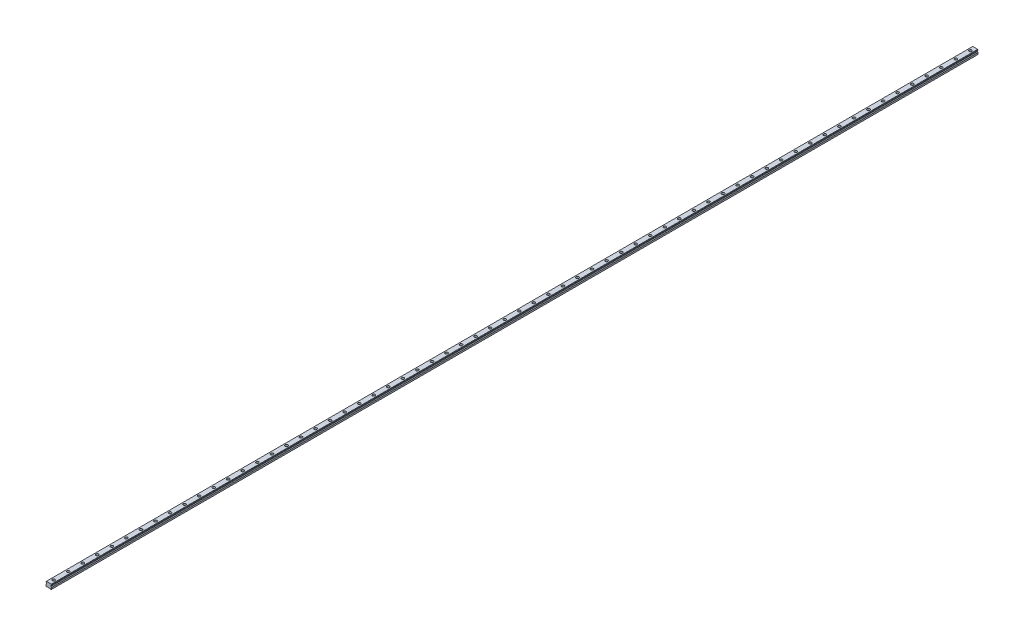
from build123d import *

# Parameters (mm, degrees)
SKETCH1_W           = 23
SKETCH1_H           = 19.2
BOSS_EXTRUDE1_DEPTH = 1910
CUT_EXTRUDE1_DEPTH  = 3821.065560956
CHAMFER1_SIZE       = 1.25
FILLET1_R           = 1.25
CUT_EXTRUDE2_DEPTH  = 3821.065560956
SKETCH4_R           = 5.5
SKETCH4_R_2         = 3.5
CUT_EXTRUDE3_DEPTH  = 9
SKETCH4_2_R         = 3.5
CUT_EXTRUDE4_DEPTH  = 1911.131118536
LPATTERN1_COUNT     = 64
LPATTERN1_PITCH     = 60


with BuildPart() as part:
    # Sketch1 → Boss-Extrude1 (new, symmetric)
    with BuildSketch(Plane.XY):
        with Locations((0, 9.6)):
            Rectangle(SKETCH1_W, SKETCH1_H)
    extrude(amount=BOSS_EXTRUDE1_DEPTH, both=True)

    # Sketch2 → Cut-Extrude1 (cut, through all)
    with BuildSketch(Plane.XY.offset(1910)):
        Polygon((-11.5, 16.7), (-11.5, 7.95), (-8.583333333, 10.866666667), (-8.583333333, 13.783333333), align=None)
        Polygon((8.583333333, 13.783333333), (11.5, 16.7), (11.5, 7.95), (8.583333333, 10.866666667), align=None)
    extrude(amount=-CUT_EXTRUDE1_DEPTH, mode=Mode.SUBTRACT)

    # Chamfer1
    chamfer1_edges = [part.edges().sort_by_distance(p)[0] for p in [
        (-11.5, 19.2, 0),
        (11.5, 19.2, 0),
        (11.5, 0, 0),
        (-11.5, 0, 0),
    ]]
    chamfer(chamfer1_edges, length=CHAMFER1_SIZE)

    # Fillet1
    fillet1_edges = [part.edges().sort_by_distance(p)[0] for p in [
        (-8.583333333, 13.783333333, 0),
        (-8.583333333, 10.866666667, 0),
        (8.583333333, 10.866666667, 0),
        (8.583333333, 13.783333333, 0),
    ]]
    fillet(fillet1_edges, radius=FILLET1_R)

    # Sketch3 → Cut-Extrude2 (cut, through all)
    with BuildSketch(Plane.XY.offset(1910)):
        Polygon((-7, 0), (-5.75, 1.25), (5.75, 1.25), (7, 0), align=None)
    extrude(amount=-CUT_EXTRUDE2_DEPTH, mode=Mode.SUBTRACT)

    # Sketch4 → Cut-Extrude3 (cut)
    with BuildSketch(Plane(origin=(0, 19.2, 0), x_dir=(1, 0, 0), z_dir=(0, 1, 0))):
        with Locations(Location((0, -1890, 0), (0, 0, 270))):
            Circle(SKETCH4_R)
        with Locations(Location((0, -1890, 0), (0, 0, 270))):
            Circle(SKETCH4_R_2, mode=Mode.SUBTRACT)
    cut_extrude3 = extrude(amount=-CUT_EXTRUDE3_DEPTH, mode=Mode.SUBTRACT)

    # Sketch4_2 → Cut-Extrude4 (cut, through all)
    with BuildSketch(Plane(origin=(0, 19.2, 0), x_dir=(1, 0, 0), z_dir=(0, 1, 0))):
        with Locations(Location((0, -1890, 0), (0, 0, 270))):
            Circle(SKETCH4_2_R)
    cut_extrude4 = extrude(amount=-CUT_EXTRUDE4_DEPTH, mode=Mode.SUBTRACT)

    # LPattern1: Cut-Extrude3, Cut-Extrude4 ×64
    with Locations(*[(0, 0, -i * LPATTERN1_PITCH) for i in range(1, LPATTERN1_COUNT)]):
        add(cut_extrude3, mode=Mode.SUBTRACT)
        add(cut_extrude4, mode=Mode.SUBTRACT)


solid = part.part
